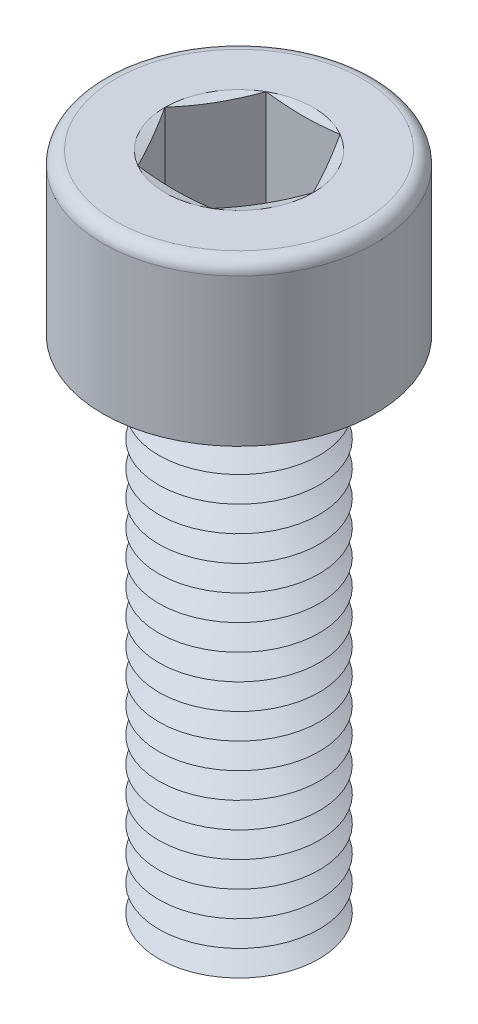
from build123d import *

# Parameters (mm, degrees)
SKETCH1_R       = 2.5
EXTRUDE1_DEPTH  = 16
SKETCH2_R       = 4.25
EXTRUDE2_DEPTH  = 5
EXTRUDE3_DEPTH  = 4
FILLET1_R       = 0.4
LPATTERN1_COUNT = 20
LPATTERN1_PITCH = 0.8


with BuildPart() as part:
    # Sketch1 → Extrude1 (new body)
    with BuildSketch(Plane(origin=(0, 0, 0), x_dir=(1, 0, 0), z_dir=(0, 1, 0))):
        with Locations(Location((0, 0, 0), (0, 0, 270))):
            Circle(SKETCH1_R)
    extrude(amount=EXTRUDE1_DEPTH)

    # Sketch2 → Extrude2 (add)
    with BuildSketch(Plane(origin=(0, 16, 0), x_dir=(1, 0, 0), z_dir=(0, 1, 0))):
        with Locations(Location((0, 0, 0), (0, 0, 270))):
            Circle(SKETCH2_R)
    extrude(amount=EXTRUDE2_DEPTH)

    # Sketch3 → Extrude3 (cut)
    with BuildSketch(Plane(origin=(0, 21, 0), x_dir=(1, 0, 0), z_dir=(0, 1, 0))):
        Polygon((1.154700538, 2), (-1.154700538, 2), (-2.309401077, 0), (-1.154700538, -2), (1.154700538, -2), (2.309401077, 0), align=None)
    extrude(amount=-EXTRUDE3_DEPTH, mode=Mode.SUBTRACT)

    # Fillet1
    fillet1_edges = [part.edges().sort_by_distance(p)[0] for p in [
        (0, 21, -4.25),
    ]]
    fillet(fillet1_edges, radius=FILLET1_R)

    # Sketch4 → Cut-Revolve1 (revolve, cut)
    with BuildSketch(Plane(origin=(0, 0, 0), x_dir=(0, 0, -1), z_dir=(1, 0, 0))):
        Polygon((-2, 17), (0, 17), (0, 15.845299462), align=None)
    revolve(axis=Axis((0, 17, 0), (0, -1, 0)), mode=Mode.SUBTRACT)

    # Sketch5 → Cut-Revolve2 (revolve, cut)
    with BuildSketch(Plane.XY, mode=Mode.PRIVATE) as cut_revolve2_sk:
        Polygon((-2.5, 0.4), (-2.5, -0.4), (-1.807179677, 0), align=None)
    cut_revolve2 = revolve(cut_revolve2_sk.sketch.rotate(Axis((0, 16, 0), (0, -1, 0)), 270), axis=Axis((0, 16, 0), (0, -1, 0)), mode=Mode.SUBTRACT)

    # LPattern1: Cut-Revolve2 ×20
    with Locations(*[(0, i * LPATTERN1_PITCH, 0) for i in range(1, LPATTERN1_COUNT)]):
        add(cut_revolve2, mode=Mode.SUBTRACT)

    # Extrude4 cone 1 section (on through the dimple's axis) → Extrude4 (revolve, cut)
    with BuildSketch(Plane(origin=(0, 21, 0), x_dir=(0, 0, 1), z_dir=(1, 0, 0))):
        Polygon((0, 0), (2.309401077, 0), (0, 0.618802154), align=None)
    revolve(axis=Axis((0, 21, 0), (0, -1, 0)), mode=Mode.SUBTRACT)


solid = part.part
